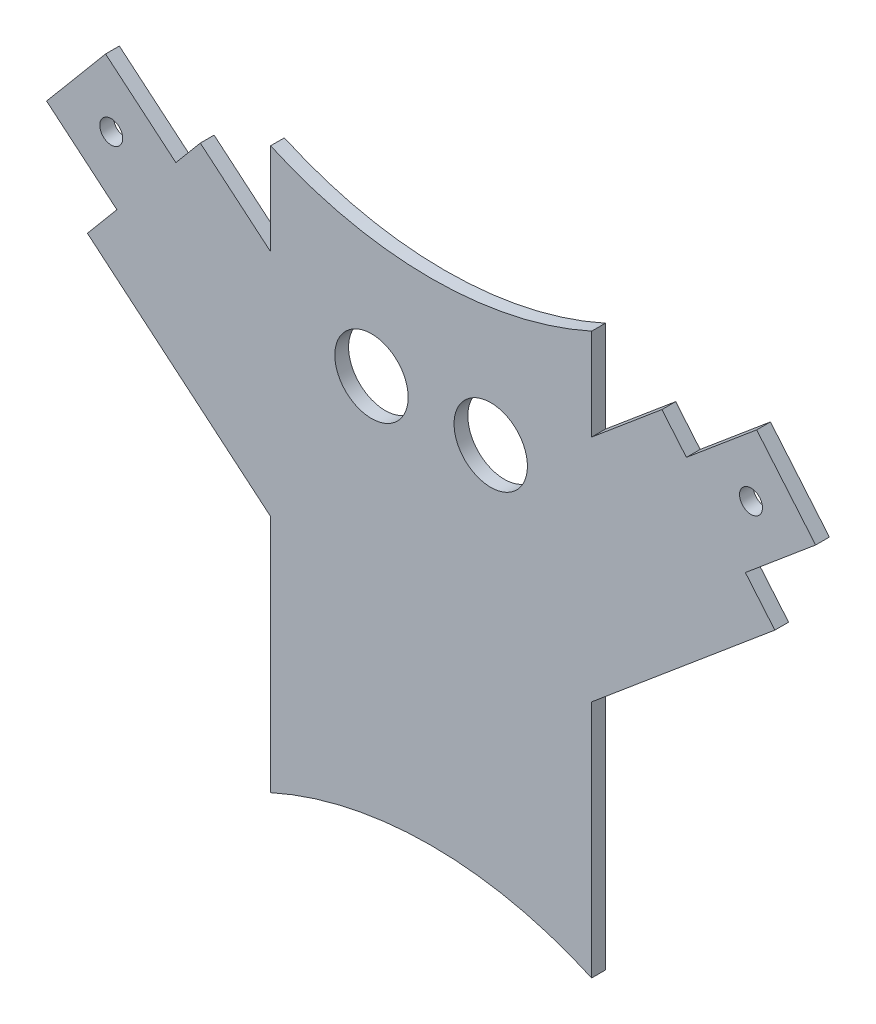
ISO-10303-21;
HEADER;
FILE_DESCRIPTION(('STEP AP214'),'2;1');
FILE_NAME('part.step','',(''),(''),'','','');
FILE_SCHEMA(('AUTOMOTIVE_DESIGN { 1 0 10303 214 1 1 1 1 }'));
ENDSEC;
DATA;
#1=APPLICATION_CONTEXT('core data for automotive mechanical design processes');
#2=APPLICATION_PROTOCOL_DEFINITION('international standard','automotive_design',2000,#1);
#3=PRODUCT_CONTEXT('',#1,'mechanical');
#4=PRODUCT('Part','Part','',(#3));
#5=PRODUCT_RELATED_PRODUCT_CATEGORY('part','',(#4));
#6=PRODUCT_DEFINITION_FORMATION('','',#4);
#7=PRODUCT_DEFINITION_CONTEXT('part definition',#1,'design');
#8=PRODUCT_DEFINITION('design','',#6,#7);
#9=PRODUCT_DEFINITION_SHAPE('','',#8);
#10=(LENGTH_UNIT() NAMED_UNIT(*) SI_UNIT(.MILLI.,.METRE.));
#11=(NAMED_UNIT(*) PLANE_ANGLE_UNIT() SI_UNIT($,.RADIAN.));
#12=(NAMED_UNIT(*) SI_UNIT($,.STERADIAN.) SOLID_ANGLE_UNIT());
#13=UNCERTAINTY_MEASURE_WITH_UNIT(LENGTH_MEASURE(1.E-05),#10,'distance_accuracy_value','');
#14=(GEOMETRIC_REPRESENTATION_CONTEXT(3) GLOBAL_UNCERTAINTY_ASSIGNED_CONTEXT((#13)) GLOBAL_UNIT_ASSIGNED_CONTEXT((#10,
#11,#12)) REPRESENTATION_CONTEXT('',''));
#15=CARTESIAN_POINT('',(0.,0.,0.));
#16=DIRECTION('',(0.,0.,1.));
#17=DIRECTION('',(1.,0.,0.));
#18=AXIS2_PLACEMENT_3D('',#15,#16,#17);
#19=CARTESIAN_POINT('',(48.1698288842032,40.419285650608,1.5));
#20=DIRECTION('',(-0.766044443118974,-0.642787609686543,0.));
#21=DIRECTION('',(0.642787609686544,-0.766044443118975,0.));
#22=AXIS2_PLACEMENT_3D('',#19,#20,#21);
#23=PLANE('',#22);
#24=DIRECTION('',(0.,0.,-1.));
#25=VECTOR('',#24,1.);
#26=CARTESIAN_POINT('',(68.5132065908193,16.1749921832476,1.5));
#27=LINE('',#26,#25);
#28=CARTESIAN_POINT('',(68.5132065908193,16.1749921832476,1.5));
#29=VERTEX_POINT('',#28);
#30=CARTESIAN_POINT('',(68.5132065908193,16.1749921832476,-1.5));
#31=VERTEX_POINT('',#30);
#32=EDGE_CURVE('E186',#29,#31,#27,.T.);
#33=ORIENTED_EDGE('',*,*,#32,.F.);
#34=DIRECTION('',(-0.642787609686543,0.766044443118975,0.));
#35=VECTOR('',#34,1.);
#36=CARTESIAN_POINT('',(48.1698288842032,40.419285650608,1.5));
#37=LINE('',#36,#35);
#38=CARTESIAN_POINT('',(74.9410826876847,8.51454775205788,1.5));
#39=VERTEX_POINT('',#38);
#40=EDGE_CURVE('E201',#39,#29,#37,.T.);
#41=ORIENTED_EDGE('',*,*,#40,.F.);
#42=DIRECTION('',(0.,0.,-1.));
#43=VECTOR('',#42,1.);
#44=CARTESIAN_POINT('',(74.9410826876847,8.51454775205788,1.5));
#45=LINE('',#44,#43);
#46=CARTESIAN_POINT('',(74.9410826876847,8.51454775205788,-1.5));
#47=VERTEX_POINT('',#46);
#48=EDGE_CURVE('E315',#39,#47,#45,.T.);
#49=ORIENTED_EDGE('',*,*,#48,.T.);
#50=DIRECTION('',(-0.642787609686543,0.766044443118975,0.));
#51=VECTOR('',#50,1.);
#52=CARTESIAN_POINT('',(48.1698288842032,40.419285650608,-1.5));
#53=LINE('',#52,#51);
#54=EDGE_CURVE('E203',#47,#31,#53,.T.);
#55=ORIENTED_EDGE('',*,*,#54,.T.);
#56=EDGE_LOOP('',(#33,#41,#49,#55));
#57=FACE_BOUND('',#56,.T.);
#58=ADVANCED_FACE('F44',(#57),#23,.F.);
#59=CARTESIAN_POINT('',(-48.1698288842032,40.419285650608,1.5));
#60=DIRECTION('',(-0.766044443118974,0.642787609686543,0.));
#61=DIRECTION('',(-0.642787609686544,-0.766044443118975,0.));
#62=AXIS2_PLACEMENT_3D('',#59,#60,#61);
#63=PLANE('',#62);
#64=DIRECTION('',(0.642787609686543,0.766044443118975,0.));
#65=VECTOR('',#64,1.);
#66=CARTESIAN_POINT('',(-48.1698288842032,40.419285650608,1.5));
#67=LINE('',#66,#65);
#68=CARTESIAN_POINT('',(-74.9410826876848,8.51454775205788,1.5));
#69=VERTEX_POINT('',#68);
#70=CARTESIAN_POINT('',(-68.5132065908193,16.1749921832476,1.5));
#71=VERTEX_POINT('',#70);
#72=EDGE_CURVE('E360',#69,#71,#67,.T.);
#73=ORIENTED_EDGE('',*,*,#72,.T.);
#74=DIRECTION('',(0.,0.,-1.));
#75=VECTOR('',#74,1.);
#76=CARTESIAN_POINT('',(-68.5132065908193,16.1749921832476,1.5));
#77=LINE('',#76,#75);
#78=CARTESIAN_POINT('',(-68.5132065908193,16.1749921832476,-1.5));
#79=VERTEX_POINT('',#78);
#80=EDGE_CURVE('E342',#71,#79,#77,.T.);
#81=ORIENTED_EDGE('',*,*,#80,.T.);
#82=DIRECTION('',(0.642787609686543,0.766044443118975,0.));
#83=VECTOR('',#82,1.);
#84=CARTESIAN_POINT('',(-48.1698288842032,40.419285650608,-1.5));
#85=LINE('',#84,#83);
#86=CARTESIAN_POINT('',(-74.9410826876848,8.51454775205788,-1.5));
#87=VERTEX_POINT('',#86);
#88=EDGE_CURVE('E250',#87,#79,#85,.T.);
#89=ORIENTED_EDGE('',*,*,#88,.F.);
#90=DIRECTION('',(0.,0.,-1.));
#91=VECTOR('',#90,1.);
#92=CARTESIAN_POINT('',(-74.9410826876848,8.51454775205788,1.5));
#93=LINE('',#92,#91);
#94=EDGE_CURVE('E53',#69,#87,#93,.T.);
#95=ORIENTED_EDGE('',*,*,#94,.F.);
#96=EDGE_LOOP('',(#73,#81,#89,#95));
#97=FACE_BOUND('',#96,.T.);
#98=ADVANCED_FACE('F341',(#97),#63,.T.);
#99=CARTESIAN_POINT('',(-2.15105997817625,-2.56353345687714,1.5));
#100=DIRECTION('',(0.642787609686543,0.766044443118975,0.));
#101=DIRECTION('',(-0.766044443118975,0.642787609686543,0.));
#102=AXIS2_PLACEMENT_3D('',#99,#100,#101);
#103=PLANE('',#102);
#104=DIRECTION('',(0.766044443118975,-0.642787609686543,0.));
#105=VECTOR('',#104,1.);
#106=CARTESIAN_POINT('',(-2.15105997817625,-2.56353345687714,-1.5));
#107=LINE('',#106,#105);
#108=CARTESIAN_POINT('',(-50.3208888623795,37.8557521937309,-1.5));
#109=VERTEX_POINT('',#108);
#110=CARTESIAN_POINT('',(-35.,25.,-1.5));
#111=VERTEX_POINT('',#110);
#112=EDGE_CURVE('E244',#109,#111,#107,.T.);
#113=ORIENTED_EDGE('',*,*,#112,.F.);
#114=DIRECTION('',(0.,0.,-1.));
#115=VECTOR('',#114,1.);
#116=CARTESIAN_POINT('',(-50.3208888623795,37.8557521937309,1.5));
#117=LINE('',#116,#115);
#118=CARTESIAN_POINT('',(-50.3208888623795,37.8557521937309,1.5));
#119=VERTEX_POINT('',#118);
#120=EDGE_CURVE('E11',#119,#109,#117,.T.);
#121=ORIENTED_EDGE('',*,*,#120,.F.);
#122=DIRECTION('',(0.766044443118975,-0.642787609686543,0.));
#123=VECTOR('',#122,1.);
#124=CARTESIAN_POINT('',(-2.15105997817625,-2.56353345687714,1.5));
#125=LINE('',#124,#123);
#126=CARTESIAN_POINT('',(-35.,25.,1.5));
#127=VERTEX_POINT('',#126);
#128=EDGE_CURVE('E299',#119,#127,#125,.T.);
#129=ORIENTED_EDGE('',*,*,#128,.T.);
#130=DIRECTION('',(0.,0.,-1.));
#131=VECTOR('',#130,1.);
#132=CARTESIAN_POINT('',(-35.,25.,1.5));
#133=LINE('',#132,#131);
#134=EDGE_CURVE('E243',#127,#111,#133,.T.);
#135=ORIENTED_EDGE('',*,*,#134,.T.);
#136=EDGE_LOOP('',(#113,#121,#129,#135));
#137=FACE_BOUND('',#136,.T.);
#138=ADVANCED_FACE('F46',(#137),#103,.T.);
#139=DIRECTION('',(0.,0.,-1.));
#140=VECTOR('',#139,1.);
#141=CARTESIAN_POINT('',(-55.6574543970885,31.4958810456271,1.5));
#142=LINE('',#141,#140);
#143=CARTESIAN_POINT('',(-55.6574543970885,31.4958810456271,1.5));
#144=VERTEX_POINT('',#143);
#145=CARTESIAN_POINT('',(-55.6574543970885,31.4958810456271,-1.5));
#146=VERTEX_POINT('',#145);
#147=EDGE_CURVE('E418',#144,#146,#142,.T.);
#148=ORIENTED_EDGE('',*,*,#147,.F.);
#149=EDGE_CURVE('E364',#144,#119,#67,.T.);
#150=ORIENTED_EDGE('',*,*,#149,.T.);
#151=ORIENTED_EDGE('',*,*,#120,.T.);
#152=EDGE_CURVE('E248',#146,#109,#85,.T.);
#153=ORIENTED_EDGE('',*,*,#152,.F.);
#154=EDGE_LOOP('',(#148,#150,#151,#153));
#155=FACE_BOUND('',#154,.T.);
#156=ADVANCED_FACE('F449',(#155),#63,.T.);
#157=CARTESIAN_POINT('',(-26.7712538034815,-31.9047378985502,1.5));
#158=DIRECTION('',(-0.642787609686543,-0.766044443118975,0.));
#159=DIRECTION('',(0.766044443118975,-0.642787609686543,0.));
#160=AXIS2_PLACEMENT_3D('',#157,#158,#159);
#161=PLANE('',#160);
#162=DIRECTION('',(-0.766044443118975,0.642787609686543,0.));
#163=VECTOR('',#162,1.);
#164=CARTESIAN_POINT('',(-26.7712538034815,-31.9047378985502,-1.5));
#165=LINE('',#164,#163);
#166=CARTESIAN_POINT('',(-35.,-25.,-1.5));
#167=VERTEX_POINT('',#166);
#168=EDGE_CURVE('E254',#167,#87,#165,.T.);
#169=ORIENTED_EDGE('',*,*,#168,.F.);
#170=DIRECTION('',(0.,0.,-1.));
#171=VECTOR('',#170,1.);
#172=CARTESIAN_POINT('',(-35.,-25.,1.5));
#173=LINE('',#172,#171);
#174=CARTESIAN_POINT('',(-35.,-25.,1.5));
#175=VERTEX_POINT('',#174);
#176=EDGE_CURVE('E328',#175,#167,#173,.T.);
#177=ORIENTED_EDGE('',*,*,#176,.F.);
#178=DIRECTION('',(-0.766044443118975,0.642787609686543,0.));
#179=VECTOR('',#178,1.);
#180=CARTESIAN_POINT('',(-26.7712538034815,-31.9047378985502,1.5));
#181=LINE('',#180,#179);
#182=EDGE_CURVE('E337',#175,#69,#181,.T.);
#183=ORIENTED_EDGE('',*,*,#182,.T.);
#184=ORIENTED_EDGE('',*,*,#94,.T.);
#185=EDGE_LOOP('',(#169,#177,#183,#184));
#186=FACE_BOUND('',#185,.T.);
#187=ADVANCED_FACE('F335',(#186),#161,.T.);
#188=CARTESIAN_POINT('',(-35.,0.,1.5));
#189=DIRECTION('',(1.,0.,0.));
#190=DIRECTION('',(0.,1.,0.));
#191=AXIS2_PLACEMENT_3D('',#188,#189,#190);
#192=PLANE('',#191);
#193=DIRECTION('',(0.,-1.,0.));
#194=VECTOR('',#193,1.);
#195=CARTESIAN_POINT('',(-35.,0.,-1.5));
#196=LINE('',#195,#194);
#197=CARTESIAN_POINT('',(-35.,-77.1393804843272,-1.5));
#198=VERTEX_POINT('',#197);
#199=EDGE_CURVE('E258',#167,#198,#196,.T.);
#200=ORIENTED_EDGE('',*,*,#199,.T.);
#201=DIRECTION('',(0.,0.,-1.));
#202=VECTOR('',#201,1.);
#203=CARTESIAN_POINT('',(-35.,-77.1393804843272,1.5));
#204=LINE('',#203,#202);
#205=CARTESIAN_POINT('',(-35.,-77.1393804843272,1.5));
#206=VERTEX_POINT('',#205);
#207=EDGE_CURVE('E325',#206,#198,#204,.T.);
#208=ORIENTED_EDGE('',*,*,#207,.F.);
#209=DIRECTION('',(0.,-1.,0.));
#210=VECTOR('',#209,1.);
#211=CARTESIAN_POINT('',(-35.,0.,1.5));
#212=LINE('',#211,#210);
#213=EDGE_CURVE('E354',#175,#206,#212,.T.);
#214=ORIENTED_EDGE('',*,*,#213,.F.);
#215=ORIENTED_EDGE('',*,*,#176,.T.);
#216=EDGE_LOOP('',(#200,#208,#214,#215));
#217=FACE_BOUND('',#216,.T.);
#218=ADVANCED_FACE('F351',(#217),#192,.F.);
#219=CARTESIAN_POINT('',(0.,-154.599047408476,1.5));
#220=DIRECTION('',(0.,0.,-1.));
#221=DIRECTION('',(-1.,0.,0.));
#222=AXIS2_PLACEMENT_3D('',#219,#220,#221);
#223=CYLINDRICAL_SURFACE('',#222,85.);
#224=CARTESIAN_POINT('',(0.,-154.599047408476,-1.5));
#225=DIRECTION('',(0.,0.,1.));
#226=DIRECTION('',(1.,0.,0.));
#227=AXIS2_PLACEMENT_3D('',#224,#225,#226);
#228=CIRCLE('',#227,85.);
#229=CARTESIAN_POINT('',(35.,-77.1393804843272,-1.5));
#230=VERTEX_POINT('',#229);
#231=EDGE_CURVE('E262',#230,#198,#228,.T.);
#232=ORIENTED_EDGE('',*,*,#231,.F.);
#233=DIRECTION('',(0.,0.,-1.));
#234=VECTOR('',#233,1.);
#235=CARTESIAN_POINT('',(35.,-77.1393804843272,1.5));
#236=LINE('',#235,#234);
#237=CARTESIAN_POINT('',(35.,-77.1393804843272,1.5));
#238=VERTEX_POINT('',#237);
#239=EDGE_CURVE('E322',#238,#230,#236,.T.);
#240=ORIENTED_EDGE('',*,*,#239,.F.);
#241=CARTESIAN_POINT('',(0.,-154.599047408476,1.5));
#242=DIRECTION('',(0.,0.,1.));
#243=DIRECTION('',(1.,0.,0.));
#244=AXIS2_PLACEMENT_3D('',#241,#242,#243);
#245=CIRCLE('',#244,85.);
#246=EDGE_CURVE('E357',#238,#206,#245,.T.);
#247=ORIENTED_EDGE('',*,*,#246,.T.);
#248=ORIENTED_EDGE('',*,*,#207,.T.);
#249=EDGE_LOOP('',(#232,#240,#247,#248));
#250=FACE_BOUND('',#249,.T.);
#251=ADVANCED_FACE('F514',(#250),#223,.F.);
#252=CARTESIAN_POINT('',(35.,0.,1.5));
#253=DIRECTION('',(-1.,0.,0.));
#254=DIRECTION('',(0.,-1.,0.));
#255=AXIS2_PLACEMENT_3D('',#252,#253,#254);
#256=PLANE('',#255);
#257=DIRECTION('',(0.,1.,0.));
#258=VECTOR('',#257,1.);
#259=CARTESIAN_POINT('',(35.,0.,-1.5));
#260=LINE('',#259,#258);
#261=CARTESIAN_POINT('',(35.,-25.,-1.5));
#262=VERTEX_POINT('',#261);
#263=EDGE_CURVE('E266',#230,#262,#260,.T.);
#264=ORIENTED_EDGE('',*,*,#263,.T.);
#265=DIRECTION('',(0.,0.,-1.));
#266=VECTOR('',#265,1.);
#267=CARTESIAN_POINT('',(35.,-25.,1.5));
#268=LINE('',#267,#266);
#269=CARTESIAN_POINT('',(35.,-25.,1.5));
#270=VERTEX_POINT('',#269);
#271=EDGE_CURVE('E318',#270,#262,#268,.T.);
#272=ORIENTED_EDGE('',*,*,#271,.F.);
#273=DIRECTION('',(0.,1.,0.));
#274=VECTOR('',#273,1.);
#275=CARTESIAN_POINT('',(35.,0.,1.5));
#276=LINE('',#275,#274);
#277=EDGE_CURVE('E369',#238,#270,#276,.T.);
#278=ORIENTED_EDGE('',*,*,#277,.F.);
#279=ORIENTED_EDGE('',*,*,#239,.T.);
#280=EDGE_LOOP('',(#264,#272,#278,#279));
#281=FACE_BOUND('',#280,.T.);
#282=ADVANCED_FACE('F375',(#281),#256,.F.);
#283=CARTESIAN_POINT('',(26.7712538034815,-31.9047378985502,1.5));
#284=DIRECTION('',(-0.642787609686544,0.766044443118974,0.));
#285=DIRECTION('',(-0.766044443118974,-0.642787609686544,0.));
#286=AXIS2_PLACEMENT_3D('',#283,#284,#285);
#287=PLANE('',#286);
#288=DIRECTION('',(0.766044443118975,0.642787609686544,0.));
#289=VECTOR('',#288,1.);
#290=CARTESIAN_POINT('',(26.7712538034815,-31.9047378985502,-1.5));
#291=LINE('',#290,#289);
#292=EDGE_CURVE('E269',#262,#47,#291,.T.);
#293=ORIENTED_EDGE('',*,*,#292,.T.);
#294=ORIENTED_EDGE('',*,*,#48,.F.);
#295=DIRECTION('',(0.766044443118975,0.642787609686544,0.));
#296=VECTOR('',#295,1.);
#297=CARTESIAN_POINT('',(26.7712538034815,-31.9047378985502,1.5));
#298=LINE('',#297,#296);
#299=EDGE_CURVE('E211',#270,#39,#298,.T.);
#300=ORIENTED_EDGE('',*,*,#299,.F.);
#301=ORIENTED_EDGE('',*,*,#271,.T.);
#302=EDGE_LOOP('',(#293,#294,#300,#301));
#303=FACE_BOUND('',#302,.T.);
#304=ADVANCED_FACE('F378',(#303),#287,.F.);
#305=CARTESIAN_POINT('',(55.6574543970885,31.4958810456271,1.5));
#306=VERTEX_POINT('',#305);
#307=CARTESIAN_POINT('',(50.3208888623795,37.8557521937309,1.5));
#308=VERTEX_POINT('',#307);
#309=EDGE_CURVE('E215',#306,#308,#37,.T.);
#310=ORIENTED_EDGE('',*,*,#309,.F.);
#311=DIRECTION('',(0.,0.,-1.));
#312=VECTOR('',#311,1.);
#313=CARTESIAN_POINT('',(55.6574543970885,31.4958810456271,1.5));
#314=LINE('',#313,#312);
#315=CARTESIAN_POINT('',(55.6574543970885,31.4958810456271,-1.5));
#316=VERTEX_POINT('',#315);
#317=EDGE_CURVE('E395',#306,#316,#314,.T.);
#318=ORIENTED_EDGE('',*,*,#317,.T.);
#319=CARTESIAN_POINT('',(50.3208888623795,37.8557521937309,-1.5));
#320=VERTEX_POINT('',#319);
#321=EDGE_CURVE('E272',#316,#320,#53,.T.);
#322=ORIENTED_EDGE('',*,*,#321,.T.);
#323=DIRECTION('',(0.,0.,-1.));
#324=VECTOR('',#323,1.);
#325=CARTESIAN_POINT('',(50.3208888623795,37.8557521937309,1.5));
#326=LINE('',#325,#324);
#327=EDGE_CURVE('E311',#308,#320,#326,.T.);
#328=ORIENTED_EDGE('',*,*,#327,.F.);
#329=EDGE_LOOP('',(#310,#318,#322,#328));
#330=FACE_BOUND('',#329,.T.);
#331=ADVANCED_FACE('F476',(#330),#23,.F.);
#332=CARTESIAN_POINT('',(2.15105997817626,-2.56353345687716,1.5));
#333=DIRECTION('',(0.642787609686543,-0.766044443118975,0.));
#334=DIRECTION('',(0.766044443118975,0.642787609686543,0.));
#335=AXIS2_PLACEMENT_3D('',#332,#333,#334);
#336=PLANE('',#335);
#337=DIRECTION('',(-0.766044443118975,-0.642787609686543,0.));
#338=VECTOR('',#337,1.);
#339=CARTESIAN_POINT('',(2.15105997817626,-2.56353345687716,-1.5));
#340=LINE('',#339,#338);
#341=CARTESIAN_POINT('',(35.,25.,-1.5));
#342=VERTEX_POINT('',#341);
#343=EDGE_CURVE('E275',#320,#342,#340,.T.);
#344=ORIENTED_EDGE('',*,*,#343,.T.);
#345=DIRECTION('',(0.,0.,-1.));
#346=VECTOR('',#345,1.);
#347=CARTESIAN_POINT('',(35.,25.,1.5));
#348=LINE('',#347,#346);
#349=CARTESIAN_POINT('',(35.,25.,1.5));
#350=VERTEX_POINT('',#349);
#351=EDGE_CURVE('E308',#350,#342,#348,.T.);
#352=ORIENTED_EDGE('',*,*,#351,.F.);
#353=DIRECTION('',(-0.766044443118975,-0.642787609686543,0.));
#354=VECTOR('',#353,1.);
#355=CARTESIAN_POINT('',(2.15105997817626,-2.56353345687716,1.5));
#356=LINE('',#355,#354);
#357=EDGE_CURVE('E214',#308,#350,#356,.T.);
#358=ORIENTED_EDGE('',*,*,#357,.F.);
#359=ORIENTED_EDGE('',*,*,#327,.T.);
#360=EDGE_LOOP('',(#344,#352,#358,#359));
#361=FACE_BOUND('',#360,.T.);
#362=ADVANCED_FACE('F480',(#361),#336,.F.);
#363=CARTESIAN_POINT('',(35.,0.,1.5));
#364=DIRECTION('',(1.,0.,0.));
#365=DIRECTION('',(0.,1.,0.));
#366=AXIS2_PLACEMENT_3D('',#363,#364,#365);
#367=PLANE('',#366);
#368=DIRECTION('',(0.,-1.,0.));
#369=VECTOR('',#368,1.);
#370=CARTESIAN_POINT('',(35.,0.,-1.5));
#371=LINE('',#370,#369);
#372=CARTESIAN_POINT('',(35.,45.,-1.5));
#373=VERTEX_POINT('',#372);
#374=EDGE_CURVE('E279',#373,#342,#371,.T.);
#375=ORIENTED_EDGE('',*,*,#374,.F.);
#376=DIRECTION('',(0.,0.,-1.));
#377=VECTOR('',#376,1.);
#378=CARTESIAN_POINT('',(35.,45.,1.5));
#379=LINE('',#378,#377);
#380=CARTESIAN_POINT('',(35.,45.,1.5));
#381=VERTEX_POINT('',#380);
#382=EDGE_CURVE('E305',#381,#373,#379,.T.);
#383=ORIENTED_EDGE('',*,*,#382,.F.);
#384=DIRECTION('',(0.,-1.,0.));
#385=VECTOR('',#384,1.);
#386=CARTESIAN_POINT('',(35.,0.,1.5));
#387=LINE('',#386,#385);
#388=EDGE_CURVE('E219',#381,#350,#387,.T.);
#389=ORIENTED_EDGE('',*,*,#388,.T.);
#390=ORIENTED_EDGE('',*,*,#351,.T.);
#391=EDGE_LOOP('',(#375,#383,#389,#390));
#392=FACE_BOUND('',#391,.T.);
#393=ADVANCED_FACE('F484',(#392),#367,.T.);
#394=CARTESIAN_POINT('',(0.,122.459666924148,1.5));
#395=DIRECTION('',(0.,0.,-1.));
#396=DIRECTION('',(-1.,0.,0.));
#397=AXIS2_PLACEMENT_3D('',#394,#395,#396);
#398=CYLINDRICAL_SURFACE('',#397,85.);
#399=CARTESIAN_POINT('',(0.,122.459666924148,-1.5));
#400=DIRECTION('',(0.,0.,1.));
#401=DIRECTION('',(1.,0.,0.));
#402=AXIS2_PLACEMENT_3D('',#399,#400,#401);
#403=CIRCLE('',#402,85.);
#404=CARTESIAN_POINT('',(-35.,45.,-1.5));
#405=VERTEX_POINT('',#404);
#406=EDGE_CURVE('E283',#405,#373,#403,.T.);
#407=ORIENTED_EDGE('',*,*,#406,.F.);
#408=DIRECTION('',(0.,0.,-1.));
#409=VECTOR('',#408,1.);
#410=CARTESIAN_POINT('',(-35.,45.,1.5));
#411=LINE('',#410,#409);
#412=CARTESIAN_POINT('',(-35.,45.,1.5));
#413=VERTEX_POINT('',#412);
#414=EDGE_CURVE('E302',#413,#405,#411,.T.);
#415=ORIENTED_EDGE('',*,*,#414,.F.);
#416=CARTESIAN_POINT('',(0.,122.459666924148,1.5));
#417=DIRECTION('',(0.,0.,1.));
#418=DIRECTION('',(1.,0.,0.));
#419=AXIS2_PLACEMENT_3D('',#416,#417,#418);
#420=CIRCLE('',#419,85.);
#421=EDGE_CURVE('E227',#413,#381,#420,.T.);
#422=ORIENTED_EDGE('',*,*,#421,.T.);
#423=ORIENTED_EDGE('',*,*,#382,.T.);
#424=EDGE_LOOP('',(#407,#415,#422,#423));
#425=FACE_BOUND('',#424,.T.);
#426=ADVANCED_FACE('F486',(#425),#398,.F.);
#427=CARTESIAN_POINT('',(13.,12.5,1.5));
#428=DIRECTION('',(0.,0.,-1.));
#429=DIRECTION('',(-1.,0.,0.));
#430=AXIS2_PLACEMENT_3D('',#427,#428,#429);
#431=CYLINDRICAL_SURFACE('',#430,8.00000000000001);
#432=CARTESIAN_POINT('',(13.,12.5,1.5));
#433=DIRECTION('',(0.,0.,1.));
#434=DIRECTION('',(1.,0.,0.));
#435=AXIS2_PLACEMENT_3D('',#432,#433,#434);
#436=CIRCLE('',#435,8.00000000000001);
#437=CARTESIAN_POINT('',(21.,12.5,1.5));
#438=VERTEX_POINT('',#437);
#439=EDGE_CURVE('E235',#438,#438,#436,.T.);
#440=ORIENTED_EDGE('',*,*,#439,.T.);
#441=EDGE_LOOP('',(#440));
#442=FACE_BOUND('',#441,.T.);
#443=CARTESIAN_POINT('',(13.,12.5,-1.5));
#444=DIRECTION('',(0.,0.,1.));
#445=DIRECTION('',(1.,0.,0.));
#446=AXIS2_PLACEMENT_3D('',#443,#444,#445);
#447=CIRCLE('',#446,8.00000000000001);
#448=CARTESIAN_POINT('',(21.,12.5,-1.5));
#449=VERTEX_POINT('',#448);
#450=EDGE_CURVE('E291',#449,#449,#447,.T.);
#451=ORIENTED_EDGE('',*,*,#450,.F.);
#452=EDGE_LOOP('',(#451));
#453=FACE_BOUND('',#452,.T.);
#454=ADVANCED_FACE('F489',(#442,#453),#431,.F.);
#455=CARTESIAN_POINT('',(-35.,0.,1.5));
#456=DIRECTION('',(-1.,0.,0.));
#457=DIRECTION('',(0.,0.,1.));
#458=AXIS2_PLACEMENT_3D('',#455,#456,#457);
#459=PLANE('',#458);
#460=DIRECTION('',(0.,1.,0.));
#461=VECTOR('',#460,1.);
#462=CARTESIAN_POINT('',(-35.,0.,-1.5));
#463=LINE('',#462,#461);
#464=EDGE_CURVE('E287',#111,#405,#463,.T.);
#465=ORIENTED_EDGE('',*,*,#464,.F.);
#466=ORIENTED_EDGE('',*,*,#134,.F.);
#467=DIRECTION('',(0.,1.,0.));
#468=VECTOR('',#467,1.);
#469=CARTESIAN_POINT('',(-35.,0.,1.5));
#470=LINE('',#469,#468);
#471=EDGE_CURVE('E231',#127,#413,#470,.T.);
#472=ORIENTED_EDGE('',*,*,#471,.T.);
#473=ORIENTED_EDGE('',*,*,#414,.T.);
#474=EDGE_LOOP('',(#465,#466,#472,#473));
#475=FACE_BOUND('',#474,.T.);
#476=ADVANCED_FACE('F457',(#475),#459,.T.);
#477=CARTESIAN_POINT('',(-13.,12.5,1.5));
#478=DIRECTION('',(0.,0.,-1.));
#479=DIRECTION('',(-1.,0.,0.));
#480=AXIS2_PLACEMENT_3D('',#477,#478,#479);
#481=CYLINDRICAL_SURFACE('',#480,8.00000000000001);
#482=CARTESIAN_POINT('',(-13.,12.5,1.5));
#483=DIRECTION('',(0.,0.,1.));
#484=DIRECTION('',(1.,0.,0.));
#485=AXIS2_PLACEMENT_3D('',#482,#483,#484);
#486=CIRCLE('',#485,8.00000000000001);
#487=CARTESIAN_POINT('',(-4.99999999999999,12.5,1.5));
#488=VERTEX_POINT('',#487);
#489=EDGE_CURVE('E239',#488,#488,#486,.F.);
#490=ORIENTED_EDGE('',*,*,#489,.F.);
#491=EDGE_LOOP('',(#490));
#492=FACE_BOUND('',#491,.T.);
#493=CARTESIAN_POINT('',(-13.,12.5,-1.5));
#494=DIRECTION('',(0.,0.,1.));
#495=DIRECTION('',(1.,0.,0.));
#496=AXIS2_PLACEMENT_3D('',#493,#494,#495);
#497=CIRCLE('',#496,8.00000000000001);
#498=CARTESIAN_POINT('',(-4.99999999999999,12.5,-1.5));
#499=VERTEX_POINT('',#498);
#500=EDGE_CURVE('E295',#499,#499,#497,.F.);
#501=ORIENTED_EDGE('',*,*,#500,.T.);
#502=EDGE_LOOP('',(#501));
#503=FACE_BOUND('',#502,.T.);
#504=ADVANCED_FACE('F561',(#492,#503),#481,.F.);
#505=CARTESIAN_POINT('',(0.,0.,1.5));
#506=DIRECTION('',(0.,0.,1.));
#507=DIRECTION('',(1.,0.,0.));
#508=AXIS2_PLACEMENT_3D('',#505,#506,#507);
#509=PLANE('',#508);
#510=ORIENTED_EDGE('',*,*,#128,.F.);
#511=ORIENTED_EDGE('',*,*,#149,.F.);
#512=DIRECTION('',(0.766044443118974,-0.642787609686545,0.));
#513=VECTOR('',#512,1.);
#514=CARTESIAN_POINT('',(-7.48762551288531,-8.923404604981,1.5));
#515=LINE('',#514,#513);
#516=CARTESIAN_POINT('',(-70.9783432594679,44.351633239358,1.5));
#517=VERTEX_POINT('',#516);
#518=EDGE_CURVE('E407',#517,#144,#515,.T.);
#519=ORIENTED_EDGE('',*,*,#518,.F.);
#520=DIRECTION('',(0.642787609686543,0.766044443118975,0.));
#521=VECTOR('',#520,1.);
#522=CARTESIAN_POINT('',(-63.4907177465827,53.2750378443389,1.5));
#523=LINE('',#522,#521);
#524=CARTESIAN_POINT('',(-83.8340954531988,29.0307443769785,1.5));
#525=VERTEX_POINT('',#524);
#526=EDGE_CURVE('E410',#525,#517,#523,.T.);
#527=ORIENTED_EDGE('',*,*,#526,.F.);
#528=DIRECTION('',(-0.766044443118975,0.642787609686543,0.));
#529=VECTOR('',#528,1.);
#530=CARTESIAN_POINT('',(-20.343377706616,-24.2442934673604,1.5));
#531=LINE('',#530,#529);
#532=EDGE_CURVE('E414',#71,#525,#531,.T.);
#533=ORIENTED_EDGE('',*,*,#532,.F.);
#534=ORIENTED_EDGE('',*,*,#72,.F.);
#535=ORIENTED_EDGE('',*,*,#182,.F.);
#536=ORIENTED_EDGE('',*,*,#213,.T.);
#537=ORIENTED_EDGE('',*,*,#246,.F.);
#538=ORIENTED_EDGE('',*,*,#277,.T.);
#539=ORIENTED_EDGE('',*,*,#299,.T.);
#540=ORIENTED_EDGE('',*,*,#40,.T.);
#541=DIRECTION('',(0.766044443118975,0.642787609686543,0.));
#542=VECTOR('',#541,1.);
#543=CARTESIAN_POINT('',(20.343377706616,-24.2442934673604,1.5));
#544=LINE('',#543,#542);
#545=CARTESIAN_POINT('',(83.8340954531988,29.0307443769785,1.5));
#546=VERTEX_POINT('',#545);
#547=EDGE_CURVE('E183',#29,#546,#544,.T.);
#548=ORIENTED_EDGE('',*,*,#547,.T.);
#549=DIRECTION('',(-0.642787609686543,0.766044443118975,0.));
#550=VECTOR('',#549,1.);
#551=CARTESIAN_POINT('',(63.4907177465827,53.2750378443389,1.5));
#552=LINE('',#551,#550);
#553=CARTESIAN_POINT('',(70.9783432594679,44.351633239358,1.5));
#554=VERTEX_POINT('',#553);
#555=EDGE_CURVE('E194',#546,#554,#552,.T.);
#556=ORIENTED_EDGE('',*,*,#555,.T.);
#557=DIRECTION('',(-0.766044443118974,-0.642787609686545,0.));
#558=VECTOR('',#557,1.);
#559=CARTESIAN_POINT('',(7.48762551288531,-8.923404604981,1.5));
#560=LINE('',#559,#558);
#561=EDGE_CURVE('E464',#554,#306,#560,.T.);
#562=ORIENTED_EDGE('',*,*,#561,.T.);
#563=ORIENTED_EDGE('',*,*,#309,.T.);
#564=ORIENTED_EDGE('',*,*,#357,.T.);
#565=ORIENTED_EDGE('',*,*,#388,.F.);
#566=ORIENTED_EDGE('',*,*,#421,.F.);
#567=ORIENTED_EDGE('',*,*,#471,.F.);
#568=EDGE_LOOP('',(#510,#511,#519,#527,#533,#534,#535,#536,#537,#538,#539,#540,#548,#556,#562,
#563,#564,#565,#566,#567));
#569=FACE_BOUND('',#568,.T.);
#570=ORIENTED_EDGE('',*,*,#439,.F.);
#571=EDGE_LOOP('',(#570));
#572=FACE_BOUND('',#571,.T.);
#573=ORIENTED_EDGE('',*,*,#489,.T.);
#574=EDGE_LOOP('',(#573));
#575=FACE_BOUND('',#574,.T.);
#576=CARTESIAN_POINT('',(-69.7457749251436,30.2633127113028,1.5));
#577=DIRECTION('',(0.,0.,1.));
#578=DIRECTION('',(1.,0.,0.));
#579=AXIS2_PLACEMENT_3D('',#576,#577,#578);
#580=CIRCLE('',#579,2.5);
#581=CARTESIAN_POINT('',(-67.2457749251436,30.2633127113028,1.5));
#582=VERTEX_POINT('',#581);
#583=EDGE_CURVE('E403',#582,#582,#580,.T.);
#584=ORIENTED_EDGE('',*,*,#583,.F.);
#585=EDGE_LOOP('',(#584));
#586=FACE_BOUND('',#585,.T.);
#587=CARTESIAN_POINT('',(69.7457749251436,30.2633127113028,1.5));
#588=DIRECTION('',(0.,0.,1.));
#589=DIRECTION('',(1.,0.,0.));
#590=AXIS2_PLACEMENT_3D('',#587,#588,#589);
#591=CIRCLE('',#590,2.5);
#592=CARTESIAN_POINT('',(72.2457749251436,30.2633127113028,1.5));
#593=VERTEX_POINT('',#592);
#594=EDGE_CURVE('E387',#593,#593,#591,.F.);
#595=ORIENTED_EDGE('',*,*,#594,.T.);
#596=EDGE_LOOP('',(#595));
#597=FACE_BOUND('',#596,.T.);
#598=ADVANCED_FACE('F208',(#569,#572,#575,#586,#597),#509,.T.);
#599=CARTESIAN_POINT('',(0.,0.,-1.5));
#600=DIRECTION('',(0.,0.,1.));
#601=DIRECTION('',(1.,0.,0.));
#602=AXIS2_PLACEMENT_3D('',#599,#600,#601);
#603=PLANE('',#602);
#604=ORIENTED_EDGE('',*,*,#112,.T.);
#605=ORIENTED_EDGE('',*,*,#464,.T.);
#606=ORIENTED_EDGE('',*,*,#406,.T.);
#607=ORIENTED_EDGE('',*,*,#374,.T.);
#608=ORIENTED_EDGE('',*,*,#343,.F.);
#609=ORIENTED_EDGE('',*,*,#321,.F.);
#610=DIRECTION('',(-0.766044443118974,-0.642787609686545,0.));
#611=VECTOR('',#610,1.);
#612=CARTESIAN_POINT('',(7.48762551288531,-8.923404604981,-1.5));
#613=LINE('',#612,#611);
#614=CARTESIAN_POINT('',(70.9783432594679,44.351633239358,-1.5));
#615=VERTEX_POINT('',#614);
#616=EDGE_CURVE('E60',#615,#316,#613,.T.);
#617=ORIENTED_EDGE('',*,*,#616,.F.);
#618=DIRECTION('',(-0.642787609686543,0.766044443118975,0.));
#619=VECTOR('',#618,1.);
#620=CARTESIAN_POINT('',(63.4907177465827,53.2750378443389,-1.5));
#621=LINE('',#620,#619);
#622=CARTESIAN_POINT('',(83.8340954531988,29.0307443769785,-1.5));
#623=VERTEX_POINT('',#622);
#624=EDGE_CURVE('E381',#623,#615,#621,.T.);
#625=ORIENTED_EDGE('',*,*,#624,.F.);
#626=DIRECTION('',(0.766044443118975,0.642787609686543,0.));
#627=VECTOR('',#626,1.);
#628=CARTESIAN_POINT('',(20.343377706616,-24.2442934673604,-1.5));
#629=LINE('',#628,#627);
#630=EDGE_CURVE('E380',#31,#623,#629,.T.);
#631=ORIENTED_EDGE('',*,*,#630,.F.);
#632=ORIENTED_EDGE('',*,*,#54,.F.);
#633=ORIENTED_EDGE('',*,*,#292,.F.);
#634=ORIENTED_EDGE('',*,*,#263,.F.);
#635=ORIENTED_EDGE('',*,*,#231,.T.);
#636=ORIENTED_EDGE('',*,*,#199,.F.);
#637=ORIENTED_EDGE('',*,*,#168,.T.);
#638=ORIENTED_EDGE('',*,*,#88,.T.);
#639=DIRECTION('',(-0.766044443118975,0.642787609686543,0.));
#640=VECTOR('',#639,1.);
#641=CARTESIAN_POINT('',(-20.343377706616,-24.2442934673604,-1.5));
#642=LINE('',#641,#640);
#643=CARTESIAN_POINT('',(-83.8340954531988,29.0307443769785,-1.5));
#644=VERTEX_POINT('',#643);
#645=EDGE_CURVE('E68',#79,#644,#642,.T.);
#646=ORIENTED_EDGE('',*,*,#645,.T.);
#647=DIRECTION('',(0.642787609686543,0.766044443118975,0.));
#648=VECTOR('',#647,1.);
#649=CARTESIAN_POINT('',(-63.4907177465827,53.2750378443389,-1.5));
#650=LINE('',#649,#648);
#651=CARTESIAN_POINT('',(-70.9783432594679,44.351633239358,-1.5));
#652=VERTEX_POINT('',#651);
#653=EDGE_CURVE('E426',#644,#652,#650,.T.);
#654=ORIENTED_EDGE('',*,*,#653,.T.);
#655=DIRECTION('',(0.766044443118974,-0.642787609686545,0.));
#656=VECTOR('',#655,1.);
#657=CARTESIAN_POINT('',(-7.48762551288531,-8.923404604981,-1.5));
#658=LINE('',#657,#656);
#659=EDGE_CURVE('E422',#652,#146,#658,.T.);
#660=ORIENTED_EDGE('',*,*,#659,.T.);
#661=ORIENTED_EDGE('',*,*,#152,.T.);
#662=EDGE_LOOP('',(#604,#605,#606,#607,#608,#609,#617,#625,#631,#632,#633,#634,#635,#636,#637,
#638,#646,#654,#660,#661));
#663=FACE_BOUND('',#662,.T.);
#664=ORIENTED_EDGE('',*,*,#450,.T.);
#665=EDGE_LOOP('',(#664));
#666=FACE_BOUND('',#665,.T.);
#667=ORIENTED_EDGE('',*,*,#500,.F.);
#668=EDGE_LOOP('',(#667));
#669=FACE_BOUND('',#668,.T.);
#670=CARTESIAN_POINT('',(-69.7457749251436,30.2633127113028,-1.5));
#671=DIRECTION('',(0.,0.,1.));
#672=DIRECTION('',(1.,0.,0.));
#673=AXIS2_PLACEMENT_3D('',#670,#671,#672);
#674=CIRCLE('',#673,2.5);
#675=CARTESIAN_POINT('',(-67.2457749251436,30.2633127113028,-1.5));
#676=VERTEX_POINT('',#675);
#677=EDGE_CURVE('E205',#676,#676,#674,.T.);
#678=ORIENTED_EDGE('',*,*,#677,.T.);
#679=EDGE_LOOP('',(#678));
#680=FACE_BOUND('',#679,.T.);
#681=CARTESIAN_POINT('',(69.7457749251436,30.2633127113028,-1.5));
#682=DIRECTION('',(0.,0.,1.));
#683=DIRECTION('',(1.,0.,0.));
#684=AXIS2_PLACEMENT_3D('',#681,#682,#683);
#685=CIRCLE('',#684,2.5);
#686=CARTESIAN_POINT('',(72.2457749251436,30.2633127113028,-1.5));
#687=VERTEX_POINT('',#686);
#688=EDGE_CURVE('E195',#687,#687,#685,.F.);
#689=ORIENTED_EDGE('',*,*,#688,.F.);
#690=EDGE_LOOP('',(#689));
#691=FACE_BOUND('',#690,.T.);
#692=ADVANCED_FACE('F345',(#663,#666,#669,#680,#691),#603,.F.);
#693=CARTESIAN_POINT('',(-7.48762551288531,-8.923404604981,1.5));
#694=DIRECTION('',(0.642787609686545,0.766044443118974,0.));
#695=DIRECTION('',(-0.766044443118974,0.642787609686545,0.));
#696=AXIS2_PLACEMENT_3D('',#693,#694,#695);
#697=PLANE('',#696);
#698=ORIENTED_EDGE('',*,*,#659,.F.);
#699=DIRECTION('',(0.,0.,-1.));
#700=VECTOR('',#699,1.);
#701=CARTESIAN_POINT('',(-70.9783432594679,44.351633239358,1.5));
#702=LINE('',#701,#700);
#703=EDGE_CURVE('E249',#517,#652,#702,.T.);
#704=ORIENTED_EDGE('',*,*,#703,.F.);
#705=ORIENTED_EDGE('',*,*,#518,.T.);
#706=ORIENTED_EDGE('',*,*,#147,.T.);
#707=EDGE_LOOP('',(#698,#704,#705,#706));
#708=FACE_BOUND('',#707,.T.);
#709=ADVANCED_FACE('F573',(#708),#697,.T.);
#710=CARTESIAN_POINT('',(-63.4907177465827,53.2750378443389,1.5));
#711=DIRECTION('',(-0.766044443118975,0.642787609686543,0.));
#712=DIRECTION('',(-0.642787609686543,-0.766044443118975,0.));
#713=AXIS2_PLACEMENT_3D('',#710,#711,#712);
#714=PLANE('',#713);
#715=ORIENTED_EDGE('',*,*,#653,.F.);
#716=DIRECTION('',(0.,0.,-1.));
#717=VECTOR('',#716,1.);
#718=CARTESIAN_POINT('',(-83.8340954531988,29.0307443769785,1.5));
#719=LINE('',#718,#717);
#720=EDGE_CURVE('E436',#525,#644,#719,.T.);
#721=ORIENTED_EDGE('',*,*,#720,.F.);
#722=ORIENTED_EDGE('',*,*,#526,.T.);
#723=ORIENTED_EDGE('',*,*,#703,.T.);
#724=EDGE_LOOP('',(#715,#721,#722,#723));
#725=FACE_BOUND('',#724,.T.);
#726=ADVANCED_FACE('F582',(#725),#714,.T.);
#727=CARTESIAN_POINT('',(-20.343377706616,-24.2442934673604,1.5));
#728=DIRECTION('',(-0.642787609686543,-0.766044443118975,0.));
#729=DIRECTION('',(0.766044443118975,-0.642787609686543,0.));
#730=AXIS2_PLACEMENT_3D('',#727,#728,#729);
#731=PLANE('',#730);
#732=ORIENTED_EDGE('',*,*,#645,.F.);
#733=ORIENTED_EDGE('',*,*,#80,.F.);
#734=ORIENTED_EDGE('',*,*,#532,.T.);
#735=ORIENTED_EDGE('',*,*,#720,.T.);
#736=EDGE_LOOP('',(#732,#733,#734,#735));
#737=FACE_BOUND('',#736,.T.);
#738=ADVANCED_FACE('F593',(#737),#731,.T.);
#739=CARTESIAN_POINT('',(-69.7457749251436,30.2633127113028,1.5));
#740=DIRECTION('',(0.,0.,-1.));
#741=DIRECTION('',(-1.,0.,0.));
#742=AXIS2_PLACEMENT_3D('',#739,#740,#741);
#743=CYLINDRICAL_SURFACE('',#742,2.5);
#744=ORIENTED_EDGE('',*,*,#583,.T.);
#745=EDGE_LOOP('',(#744));
#746=FACE_BOUND('',#745,.T.);
#747=ORIENTED_EDGE('',*,*,#677,.F.);
#748=EDGE_LOOP('',(#747));
#749=FACE_BOUND('',#748,.T.);
#750=ADVANCED_FACE('F604',(#746,#749),#743,.F.);
#751=CARTESIAN_POINT('',(20.343377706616,-24.2442934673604,1.5));
#752=DIRECTION('',(-0.642787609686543,0.766044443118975,0.));
#753=DIRECTION('',(-0.766044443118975,-0.642787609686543,0.));
#754=AXIS2_PLACEMENT_3D('',#751,#752,#753);
#755=PLANE('',#754);
#756=ORIENTED_EDGE('',*,*,#630,.T.);
#757=DIRECTION('',(0.,0.,-1.));
#758=VECTOR('',#757,1.);
#759=CARTESIAN_POINT('',(83.8340954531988,29.0307443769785,1.5));
#760=LINE('',#759,#758);
#761=EDGE_CURVE('E189',#546,#623,#760,.T.);
#762=ORIENTED_EDGE('',*,*,#761,.F.);
#763=ORIENTED_EDGE('',*,*,#547,.F.);
#764=ORIENTED_EDGE('',*,*,#32,.T.);
#765=EDGE_LOOP('',(#756,#762,#763,#764));
#766=FACE_BOUND('',#765,.T.);
#767=ADVANCED_FACE('F185',(#766),#755,.F.);
#768=CARTESIAN_POINT('',(63.4907177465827,53.2750378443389,1.5));
#769=DIRECTION('',(-0.766044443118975,-0.642787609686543,0.));
#770=DIRECTION('',(0.642787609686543,-0.766044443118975,0.));
#771=AXIS2_PLACEMENT_3D('',#768,#769,#770);
#772=PLANE('',#771);
#773=ORIENTED_EDGE('',*,*,#624,.T.);
#774=DIRECTION('',(0.,0.,-1.));
#775=VECTOR('',#774,1.);
#776=CARTESIAN_POINT('',(70.9783432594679,44.351633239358,1.5));
#777=LINE('',#776,#775);
#778=EDGE_CURVE('E398',#554,#615,#777,.T.);
#779=ORIENTED_EDGE('',*,*,#778,.F.);
#780=ORIENTED_EDGE('',*,*,#555,.F.);
#781=ORIENTED_EDGE('',*,*,#761,.T.);
#782=EDGE_LOOP('',(#773,#779,#780,#781));
#783=FACE_BOUND('',#782,.T.);
#784=ADVANCED_FACE('F470',(#783),#772,.F.);
#785=CARTESIAN_POINT('',(7.48762551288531,-8.923404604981,1.5));
#786=DIRECTION('',(0.642787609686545,-0.766044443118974,0.));
#787=DIRECTION('',(0.766044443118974,0.642787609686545,0.));
#788=AXIS2_PLACEMENT_3D('',#785,#786,#787);
#789=PLANE('',#788);
#790=ORIENTED_EDGE('',*,*,#616,.T.);
#791=ORIENTED_EDGE('',*,*,#317,.F.);
#792=ORIENTED_EDGE('',*,*,#561,.F.);
#793=ORIENTED_EDGE('',*,*,#778,.T.);
#794=EDGE_LOOP('',(#790,#791,#792,#793));
#795=FACE_BOUND('',#794,.T.);
#796=ADVANCED_FACE('F471',(#795),#789,.F.);
#797=CARTESIAN_POINT('',(69.7457749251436,30.2633127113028,1.5));
#798=DIRECTION('',(0.,0.,-1.));
#799=DIRECTION('',(-1.,0.,0.));
#800=AXIS2_PLACEMENT_3D('',#797,#798,#799);
#801=CYLINDRICAL_SURFACE('',#800,2.5);
#802=ORIENTED_EDGE('',*,*,#594,.F.);
#803=EDGE_LOOP('',(#802));
#804=FACE_BOUND('',#803,.T.);
#805=ORIENTED_EDGE('',*,*,#688,.T.);
#806=EDGE_LOOP('',(#805));
#807=FACE_BOUND('',#806,.T.);
#808=ADVANCED_FACE('F642',(#804,#807),#801,.F.);
#809=CLOSED_SHELL('',(#58,#98,#138,#156,#187,#218,#251,#282,#304,#331,#362,#393,#426,#454,#476,
#504,#598,#692,#709,#726,#738,#750,#767,#784,#796,#808));
#810=MANIFOLD_SOLID_BREP('B2',#809);
#811=ADVANCED_BREP_SHAPE_REPRESENTATION('',(#18,#810),#14);
#812=SHAPE_DEFINITION_REPRESENTATION(#9,#811);
ENDSEC;
END-ISO-10303-21;
